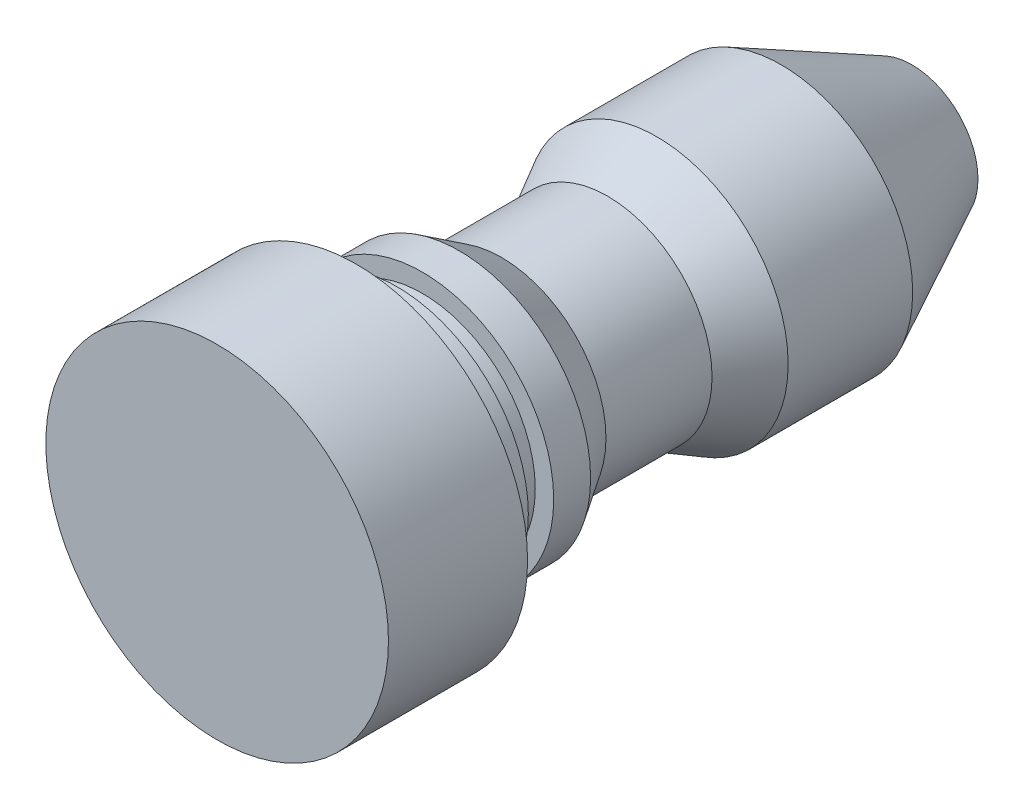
ISO-10303-21;
HEADER;
FILE_DESCRIPTION(('STEP AP214'),'2;1');
FILE_NAME('part.step','',(''),(''),'','','');
FILE_SCHEMA(('AUTOMOTIVE_DESIGN { 1 0 10303 214 1 1 1 1 }'));
ENDSEC;
DATA;
#1=APPLICATION_CONTEXT('core data for automotive mechanical design processes');
#2=APPLICATION_PROTOCOL_DEFINITION('international standard','automotive_design',2000,#1);
#3=PRODUCT_CONTEXT('',#1,'mechanical');
#4=PRODUCT('Part','Part','',(#3));
#5=PRODUCT_RELATED_PRODUCT_CATEGORY('part','',(#4));
#6=PRODUCT_DEFINITION_FORMATION('','',#4);
#7=PRODUCT_DEFINITION_CONTEXT('part definition',#1,'design');
#8=PRODUCT_DEFINITION('design','',#6,#7);
#9=PRODUCT_DEFINITION_SHAPE('','',#8);
#10=(LENGTH_UNIT() NAMED_UNIT(*) SI_UNIT(.MILLI.,.METRE.));
#11=(NAMED_UNIT(*) PLANE_ANGLE_UNIT() SI_UNIT($,.RADIAN.));
#12=(NAMED_UNIT(*) SI_UNIT($,.STERADIAN.) SOLID_ANGLE_UNIT());
#13=UNCERTAINTY_MEASURE_WITH_UNIT(LENGTH_MEASURE(1.E-05),#10,'distance_accuracy_value','');
#14=(GEOMETRIC_REPRESENTATION_CONTEXT(3) GLOBAL_UNCERTAINTY_ASSIGNED_CONTEXT((#13)) GLOBAL_UNIT_ASSIGNED_CONTEXT((#10,
#11,#12)) REPRESENTATION_CONTEXT('',''));
#15=CARTESIAN_POINT('',(0.,0.,0.));
#16=DIRECTION('',(0.,0.,1.));
#17=DIRECTION('',(1.,0.,0.));
#18=AXIS2_PLACEMENT_3D('',#15,#16,#17);
#19=CARTESIAN_POINT('',(0.,0.,26.0805335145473));
#20=DIRECTION('',(0.,0.,-1.));
#21=DIRECTION('',(-1.,0.,0.));
#22=AXIS2_PLACEMENT_3D('',#19,#20,#21);
#23=PLANE('',#22);
#24=CARTESIAN_POINT('',(0.,0.,26.0805335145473));
#25=DIRECTION('',(0.,0.,1.));
#26=DIRECTION('',(1.,0.,0.));
#27=AXIS2_PLACEMENT_3D('',#24,#25,#26);
#28=CIRCLE('',#27,10.0186321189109);
#29=CARTESIAN_POINT('',(10.0186321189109,0.,26.0805335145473));
#30=VERTEX_POINT('',#29);
#31=EDGE_CURVE('E10',#30,#30,#28,.T.);
#32=ORIENTED_EDGE('',*,*,#31,.T.);
#33=EDGE_LOOP('',(#32));
#34=FACE_BOUND('',#33,.T.);
#35=ADVANCED_FACE('F37',(#34),#23,.F.);
#36=CARTESIAN_POINT('',(0.,0.,36.223734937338));
#37=DIRECTION('',(0.,0.,1.));
#38=DIRECTION('',(1.,0.,0.));
#39=AXIS2_PLACEMENT_3D('',#36,#37,#38);
#40=CYLINDRICAL_SURFACE('',#39,10.0186321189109);
#41=ORIENTED_EDGE('',*,*,#31,.F.);
#42=EDGE_LOOP('',(#41));
#43=FACE_BOUND('',#42,.T.);
#44=CARTESIAN_POINT('',(0.,0.,17.9441175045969));
#45=DIRECTION('',(0.,0.,1.));
#46=DIRECTION('',(1.,0.,0.));
#47=AXIS2_PLACEMENT_3D('',#44,#45,#46);
#48=CIRCLE('',#47,10.0186321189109);
#49=CARTESIAN_POINT('',(10.0186321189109,0.,17.9441175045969));
#50=VERTEX_POINT('',#49);
#51=EDGE_CURVE('E44',#50,#50,#48,.T.);
#52=ORIENTED_EDGE('',*,*,#51,.T.);
#53=EDGE_LOOP('',(#52));
#54=FACE_BOUND('',#53,.T.);
#55=ADVANCED_FACE('F109',(#43,#54),#40,.T.);
#56=CARTESIAN_POINT('',(0.,10.0186321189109,17.9441175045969));
#57=DIRECTION('',(0.,0.,1.));
#58=DIRECTION('',(1.,0.,0.));
#59=AXIS2_PLACEMENT_3D('',#56,#57,#58);
#60=PLANE('',#59);
#61=ORIENTED_EDGE('',*,*,#51,.F.);
#62=EDGE_LOOP('',(#61));
#63=FACE_BOUND('',#62,.T.);
#64=CARTESIAN_POINT('',(0.,0.,17.9441175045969));
#65=DIRECTION('',(0.,0.,1.));
#66=DIRECTION('',(1.,0.,0.));
#67=AXIS2_PLACEMENT_3D('',#64,#65,#66);
#68=CIRCLE('',#67,7.68109823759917);
#69=CARTESIAN_POINT('',(7.68109823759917,0.,17.9441175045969));
#70=VERTEX_POINT('',#69);
#71=EDGE_CURVE('E49',#70,#70,#68,.T.);
#72=ORIENTED_EDGE('',*,*,#71,.T.);
#73=EDGE_LOOP('',(#72));
#74=FACE_BOUND('',#73,.T.);
#75=ADVANCED_FACE('F113',(#63,#74),#60,.F.);
#76=CARTESIAN_POINT('',(0.,0.,36.223734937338));
#77=DIRECTION('',(0.,0.,1.));
#78=DIRECTION('',(1.,0.,0.));
#79=AXIS2_PLACEMENT_3D('',#76,#77,#78);
#80=CYLINDRICAL_SURFACE('',#79,7.68109823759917);
#81=ORIENTED_EDGE('',*,*,#71,.F.);
#82=EDGE_LOOP('',(#81));
#83=FACE_BOUND('',#82,.T.);
#84=CARTESIAN_POINT('',(0.,0.,15.5616310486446));
#85=DIRECTION('',(0.,0.,1.));
#86=DIRECTION('',(1.,0.,0.));
#87=AXIS2_PLACEMENT_3D('',#84,#85,#86);
#88=CIRCLE('',#87,7.68109823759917);
#89=CARTESIAN_POINT('',(7.68109823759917,0.,15.5616310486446));
#90=VERTEX_POINT('',#89);
#91=EDGE_CURVE('E54',#90,#90,#88,.T.);
#92=ORIENTED_EDGE('',*,*,#91,.T.);
#93=EDGE_LOOP('',(#92));
#94=FACE_BOUND('',#93,.T.);
#95=ADVANCED_FACE('F118',(#83,#94),#80,.T.);
#96=CARTESIAN_POINT('',(0.,7.68109823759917,15.5616310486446));
#97=DIRECTION('',(0.,0.,1.));
#98=DIRECTION('',(1.,0.,0.));
#99=AXIS2_PLACEMENT_3D('',#96,#97,#98);
#100=PLANE('',#99);
#101=ORIENTED_EDGE('',*,*,#91,.F.);
#102=EDGE_LOOP('',(#101));
#103=FACE_BOUND('',#102,.T.);
#104=CARTESIAN_POINT('',(0.,0.,15.5616310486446));
#105=DIRECTION('',(0.,0.,1.));
#106=DIRECTION('',(1.,0.,0.));
#107=AXIS2_PLACEMENT_3D('',#104,#105,#106);
#108=CIRCLE('',#107,6.60223644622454);
#109=CARTESIAN_POINT('',(6.60223644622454,0.,15.5616310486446));
#110=VERTEX_POINT('',#109);
#111=EDGE_CURVE('E60',#110,#110,#108,.T.);
#112=ORIENTED_EDGE('',*,*,#111,.T.);
#113=EDGE_LOOP('',(#112));
#114=FACE_BOUND('',#113,.T.);
#115=ADVANCED_FACE('F124',(#103,#114),#100,.F.);
#116=CARTESIAN_POINT('',(0.,0.,36.223734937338));
#117=DIRECTION('',(0.,0.,1.));
#118=DIRECTION('',(1.,0.,0.));
#119=AXIS2_PLACEMENT_3D('',#116,#117,#118);
#120=CYLINDRICAL_SURFACE('',#119,6.60223644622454);
#121=ORIENTED_EDGE('',*,*,#111,.F.);
#122=EDGE_LOOP('',(#121));
#123=FACE_BOUND('',#122,.T.);
#124=CARTESIAN_POINT('',(0.,0.,14.0781960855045));
#125=DIRECTION('',(0.,0.,1.));
#126=DIRECTION('',(1.,0.,0.));
#127=AXIS2_PLACEMENT_3D('',#124,#125,#126);
#128=CIRCLE('',#127,6.60223644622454);
#129=CARTESIAN_POINT('',(6.60223644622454,0.,14.0781960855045));
#130=VERTEX_POINT('',#129);
#131=EDGE_CURVE('E64',#130,#130,#128,.T.);
#132=ORIENTED_EDGE('',*,*,#131,.T.);
#133=EDGE_LOOP('',(#132));
#134=FACE_BOUND('',#133,.T.);
#135=ADVANCED_FACE('F128',(#123,#134),#120,.T.);
#136=CARTESIAN_POINT('',(0.,6.60223644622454,14.0781960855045));
#137=DIRECTION('',(0.,0.,-1.));
#138=DIRECTION('',(-1.,0.,0.));
#139=AXIS2_PLACEMENT_3D('',#136,#137,#138);
#140=PLANE('',#139);
#141=ORIENTED_EDGE('',*,*,#131,.F.);
#142=EDGE_LOOP('',(#141));
#143=FACE_BOUND('',#142,.T.);
#144=CARTESIAN_POINT('',(0.,0.,14.0781960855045));
#145=DIRECTION('',(0.,0.,1.));
#146=DIRECTION('',(1.,0.,0.));
#147=AXIS2_PLACEMENT_3D('',#144,#145,#146);
#148=CIRCLE('',#147,7.68109823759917);
#149=CARTESIAN_POINT('',(7.68109823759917,0.,14.0781960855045));
#150=VERTEX_POINT('',#149);
#151=EDGE_CURVE('E68',#150,#150,#148,.T.);
#152=ORIENTED_EDGE('',*,*,#151,.T.);
#153=EDGE_LOOP('',(#152));
#154=FACE_BOUND('',#153,.T.);
#155=ADVANCED_FACE('F132',(#143,#154),#140,.F.);
#156=CARTESIAN_POINT('',(0.,0.,36.223734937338));
#157=DIRECTION('',(0.,0.,1.));
#158=DIRECTION('',(1.,0.,0.));
#159=AXIS2_PLACEMENT_3D('',#156,#157,#158);
#160=CYLINDRICAL_SURFACE('',#159,7.68109823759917);
#161=ORIENTED_EDGE('',*,*,#151,.F.);
#162=EDGE_LOOP('',(#161));
#163=FACE_BOUND('',#162,.T.);
#164=CARTESIAN_POINT('',(0.,0.,11.9204725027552));
#165=DIRECTION('',(0.,0.,1.));
#166=DIRECTION('',(1.,0.,0.));
#167=AXIS2_PLACEMENT_3D('',#164,#165,#166);
#168=CIRCLE('',#167,7.68109823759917);
#169=CARTESIAN_POINT('',(7.68109823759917,0.,11.9204725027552));
#170=VERTEX_POINT('',#169);
#171=EDGE_CURVE('E72',#170,#170,#168,.T.);
#172=ORIENTED_EDGE('',*,*,#171,.T.);
#173=EDGE_LOOP('',(#172));
#174=FACE_BOUND('',#173,.T.);
#175=ADVANCED_FACE('F136',(#163,#174),#160,.T.);
#176=CARTESIAN_POINT('',(0.,0.,9.44808089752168));
#177=DIRECTION('',(0.,0.,1.));
#178=DIRECTION('',(1.,0.,0.));
#179=AXIS2_PLACEMENT_3D('',#176,#177,#178);
#180=CONICAL_SURFACE('',#179,6.10775812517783,0.566729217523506);
#181=ORIENTED_EDGE('',*,*,#171,.F.);
#182=EDGE_LOOP('',(#181));
#183=FACE_BOUND('',#182,.T.);
#184=CARTESIAN_POINT('',(0.,0.,9.44808089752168));
#185=DIRECTION('',(0.,0.,1.));
#186=DIRECTION('',(1.,0.,0.));
#187=AXIS2_PLACEMENT_3D('',#184,#185,#186);
#188=CIRCLE('',#187,6.10775812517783);
#189=CARTESIAN_POINT('',(6.10775812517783,0.,9.44808089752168));
#190=VERTEX_POINT('',#189);
#191=EDGE_CURVE('E76',#190,#190,#188,.T.);
#192=ORIENTED_EDGE('',*,*,#191,.T.);
#193=EDGE_LOOP('',(#192));
#194=FACE_BOUND('',#193,.T.);
#195=ADVANCED_FACE('F140',(#183,#194),#180,.T.);
#196=CARTESIAN_POINT('',(0.,0.,36.223734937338));
#197=DIRECTION('',(0.,0.,1.));
#198=DIRECTION('',(1.,0.,0.));
#199=AXIS2_PLACEMENT_3D('',#196,#197,#198);
#200=CYLINDRICAL_SURFACE('',#199,6.10775812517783);
#201=ORIENTED_EDGE('',*,*,#191,.F.);
#202=EDGE_LOOP('',(#201));
#203=FACE_BOUND('',#202,.T.);
#204=CARTESIAN_POINT('',(0.,0.,3.24462559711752));
#205=DIRECTION('',(0.,0.,1.));
#206=DIRECTION('',(1.,0.,0.));
#207=AXIS2_PLACEMENT_3D('',#204,#205,#206);
#208=CIRCLE('',#207,6.10775812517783);
#209=CARTESIAN_POINT('',(6.10775812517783,0.,3.24462559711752));
#210=VERTEX_POINT('',#209);
#211=EDGE_CURVE('E80',#210,#210,#208,.T.);
#212=ORIENTED_EDGE('',*,*,#211,.T.);
#213=EDGE_LOOP('',(#212));
#214=FACE_BOUND('',#213,.T.);
#215=ADVANCED_FACE('F144',(#203,#214),#200,.T.);
#216=CARTESIAN_POINT('',(0.,0.,0.367660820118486));
#217=DIRECTION('',(0.,0.,-1.));
#218=DIRECTION('',(-1.,0.,0.));
#219=AXIS2_PLACEMENT_3D('',#216,#217,#218);
#220=CONICAL_SURFACE('',#219,7.68109823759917,0.500440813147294);
#221=ORIENTED_EDGE('',*,*,#211,.F.);
#222=EDGE_LOOP('',(#221));
#223=FACE_BOUND('',#222,.T.);
#224=CARTESIAN_POINT('',(0.,0.,0.367660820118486));
#225=DIRECTION('',(0.,0.,1.));
#226=DIRECTION('',(1.,0.,0.));
#227=AXIS2_PLACEMENT_3D('',#224,#225,#226);
#228=CIRCLE('',#227,7.68109823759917);
#229=CARTESIAN_POINT('',(7.68109823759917,0.,0.367660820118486));
#230=VERTEX_POINT('',#229);
#231=EDGE_CURVE('E84',#230,#230,#228,.T.);
#232=ORIENTED_EDGE('',*,*,#231,.T.);
#233=EDGE_LOOP('',(#232));
#234=FACE_BOUND('',#233,.T.);
#235=ADVANCED_FACE('F148',(#223,#234),#220,.T.);
#236=CARTESIAN_POINT('',(0.,0.,36.223734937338));
#237=DIRECTION('',(0.,0.,1.));
#238=DIRECTION('',(1.,0.,0.));
#239=AXIS2_PLACEMENT_3D('',#236,#237,#238);
#240=CYLINDRICAL_SURFACE('',#239,7.68109823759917);
#241=ORIENTED_EDGE('',*,*,#231,.F.);
#242=EDGE_LOOP('',(#241));
#243=FACE_BOUND('',#242,.T.);
#244=CARTESIAN_POINT('',(0.,0.,-6.91465627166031));
#245=DIRECTION('',(0.,0.,1.));
#246=DIRECTION('',(1.,0.,0.));
#247=AXIS2_PLACEMENT_3D('',#244,#245,#246);
#248=CIRCLE('',#247,7.68109823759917);
#249=CARTESIAN_POINT('',(7.68109823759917,0.,-6.91465627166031));
#250=VERTEX_POINT('',#249);
#251=EDGE_CURVE('E88',#250,#250,#248,.T.);
#252=ORIENTED_EDGE('',*,*,#251,.T.);
#253=EDGE_LOOP('',(#252));
#254=FACE_BOUND('',#253,.T.);
#255=ADVANCED_FACE('F105',(#243,#254),#240,.T.);
#256=CARTESIAN_POINT('',(0.,0.,-14.556593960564));
#257=DIRECTION('',(0.,0.,1.));
#258=DIRECTION('',(1.,0.,0.));
#259=AXIS2_PLACEMENT_3D('',#256,#257,#258);
#260=CONICAL_SURFACE('',#259,3.86012939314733,0.463647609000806);
#261=ORIENTED_EDGE('',*,*,#251,.F.);
#262=EDGE_LOOP('',(#261));
#263=FACE_BOUND('',#262,.T.);
#264=CARTESIAN_POINT('',(0.,0.,-14.556593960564));
#265=DIRECTION('',(0.,0.,1.));
#266=DIRECTION('',(1.,0.,0.));
#267=AXIS2_PLACEMENT_3D('',#264,#265,#266);
#268=CIRCLE('',#267,3.86012939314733);
#269=CARTESIAN_POINT('',(3.86012939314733,0.,-14.556593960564));
#270=VERTEX_POINT('',#269);
#271=EDGE_CURVE('E92',#270,#270,#268,.T.);
#272=ORIENTED_EDGE('',*,*,#271,.T.);
#273=EDGE_LOOP('',(#272));
#274=FACE_BOUND('',#273,.T.);
#275=ADVANCED_FACE('F97',(#263,#274),#260,.T.);
#276=CARTESIAN_POINT('',(0.,3.86012939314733,-14.556593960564));
#277=DIRECTION('',(0.,0.,1.));
#278=DIRECTION('',(1.,0.,0.));
#279=AXIS2_PLACEMENT_3D('',#276,#277,#278);
#280=PLANE('',#279);
#281=ORIENTED_EDGE('',*,*,#271,.F.);
#282=EDGE_LOOP('',(#281));
#283=FACE_BOUND('',#282,.T.);
#284=ADVANCED_FACE('F99',(#283),#280,.F.);
#285=CLOSED_SHELL('',(#35,#55,#75,#95,#115,#135,#155,#175,#195,#215,#235,#255,#275,#284));
#286=MANIFOLD_SOLID_BREP('B2',#285);
#287=ADVANCED_BREP_SHAPE_REPRESENTATION('',(#18,#286),#14);
#288=SHAPE_DEFINITION_REPRESENTATION(#9,#287);
ENDSEC;
END-ISO-10303-21;
